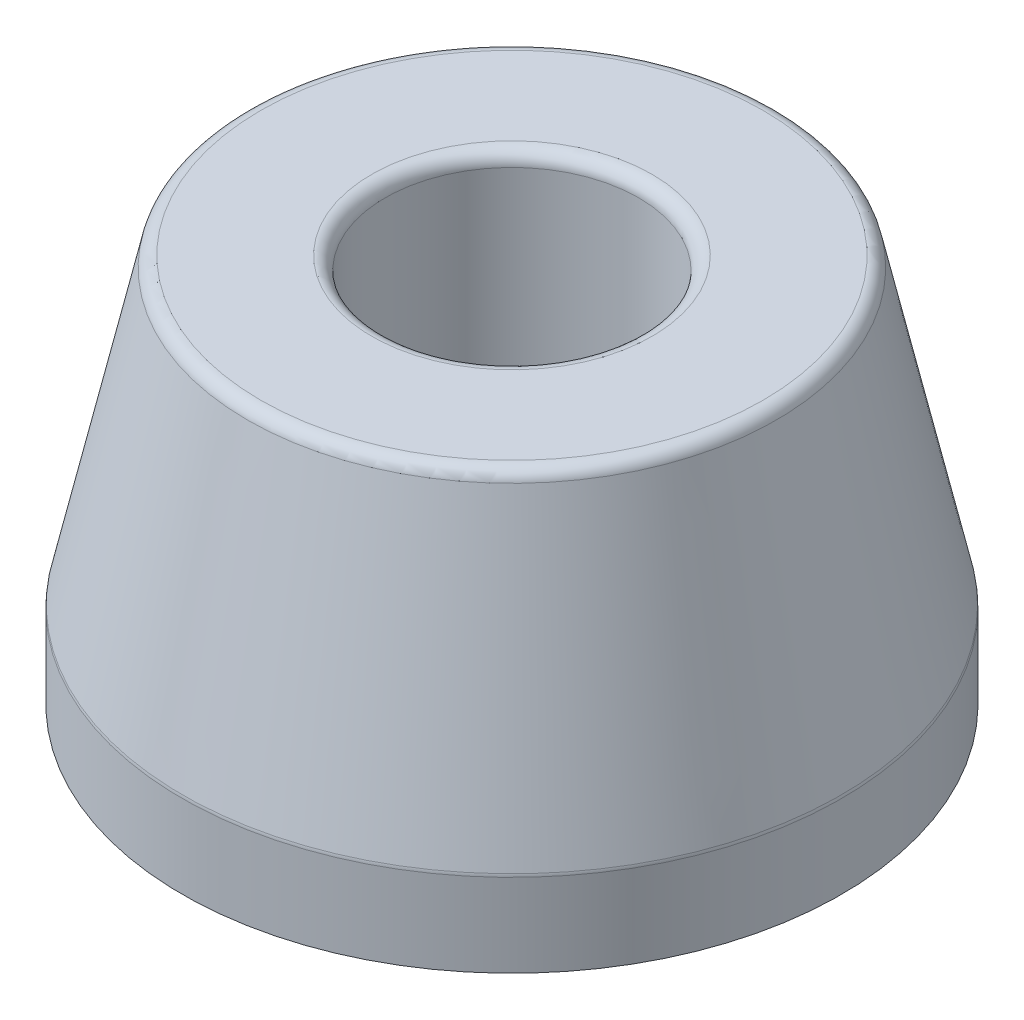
from build123d import *


with BuildPart() as part:
    # Sketch1 → Revolve1 (revolve)
    with BuildSketch(Plane.XY, mode=Mode.PRIVATE) as revolve1_sk:
        with BuildLine():
            Line((4.7625, 0), (4.7625, 14.097))
            ThreePointArc((4.7625, 14.097), (4.911289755, 14.456210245), (5.2705, 14.605))
            Line((5.2705, 14.605), (9.434996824, 14.605))
            ThreePointArc((9.434996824, 14.605), (9.75286634, 14.493261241), (9.930899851, 14.207200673))
            Line((9.930899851, 14.207200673), (12.370403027, 3.22943638))
            ThreePointArc((12.370403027, 3.22943638), (12.379466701, 3.174667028), (12.3825, 3.119235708))
            Line((12.3825, 3.119235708), (12.3825, 0))
            Line((12.3825, 0), (4.7625, 0))
        make_face()
    revolve(revolve1_sk.sketch.rotate(Axis((0, 0, 0), (0, 1, 0)), 90), axis=Axis((0, 0, 0), (0, 1, 0)))


solid = part.part
